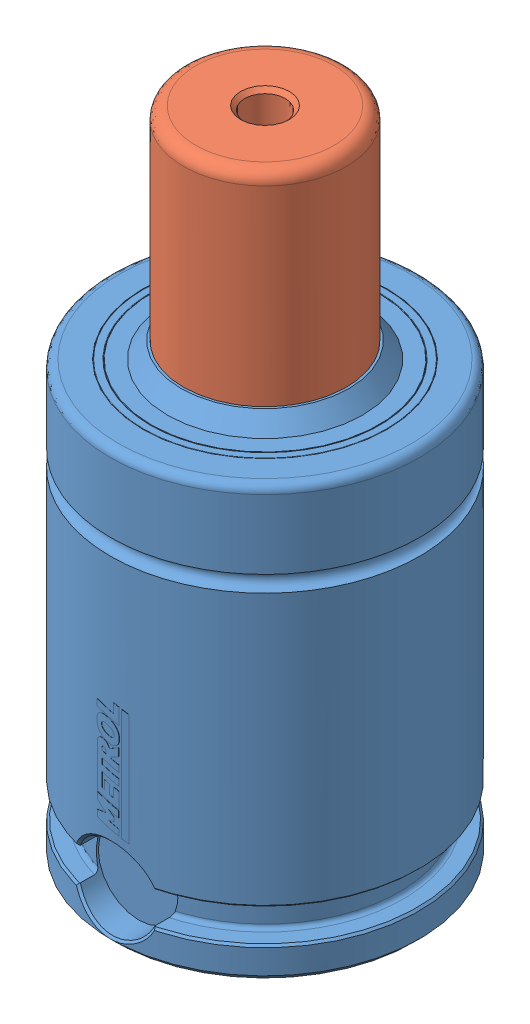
SolidWorks assembly EX0500-025.SLDASM, configuration Default (file format 7000). Lengths in mm.
Overall size (42.43 80 42.43).
2 component instances, 2 part files, 5 mates.
Components (placement in the parent):
- EX0500 Body-1: EX0500 Body.SLDPRT [EX-500-025] x (0 0 1) z (0 -1 0) size (38.1 38 55)
- EX-500 Piston-1: EX-500 Piston.SLDPRT [EX-500-025] at (0 38 0) x (-0.701814 0 -0.71236) z (0 -1 0) size (30 30 42)
Mates (geometry in assembly coordinates):
- Concentric1: concentric aligned: cylinder of EX0500 Body-1 through (0 0 0) axis (0 -1 0) radius 10; cylinder of EX-500 Piston-1 through (0 38 0) axis (0 -1 0) radius 10
- LimitDistance1: limit distance anti-aligned: plane of EX0500 Body-1 through (0 43 0) normal (0 -1 0); plane of EX-500 Piston-1 through (10.6854 43 -10.5272) normal (0 1 0)
- Coincident1: coincident anti-aligned: plane of EX0500 Body-1 through (0 0 0) normal (0 -1 0); plane of assembly through (0 0 0) normal (0 1 0)
- Coincident2: coincident anti-aligned: plane of EX0500 Body-1; plane of assembly through (0 0 0) normal (1 0 0)
- Coincident4: coincident aligned: plane of EX0500 Body-1; plane of assembly through (0 0 0) normal (0 0 1)
